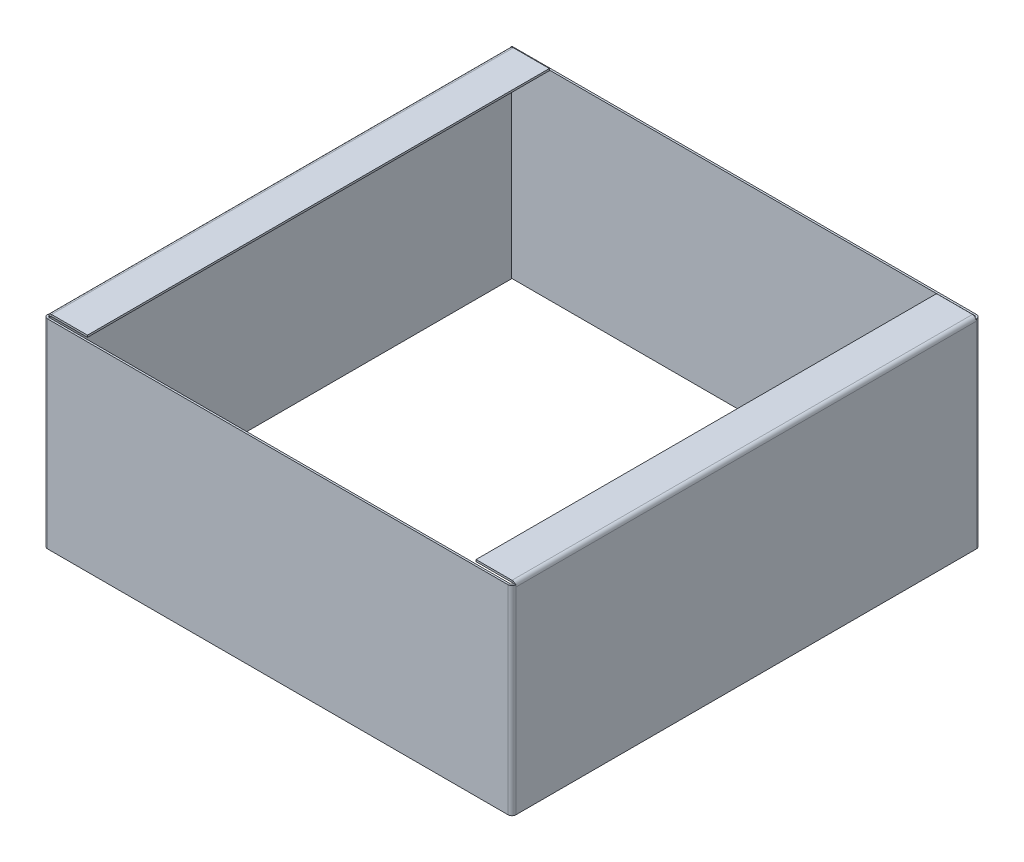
ISO-10303-21;
HEADER;
FILE_DESCRIPTION(('STEP AP214'),'2;1');
FILE_NAME('part.step','',(''),(''),'','','');
FILE_SCHEMA(('AUTOMOTIVE_DESIGN { 1 0 10303 214 1 1 1 1 }'));
ENDSEC;
DATA;
#1=APPLICATION_CONTEXT('core data for automotive mechanical design processes');
#2=APPLICATION_PROTOCOL_DEFINITION('international standard','automotive_design',2000,#1);
#3=PRODUCT_CONTEXT('',#1,'mechanical');
#4=PRODUCT('Part','Part','',(#3));
#5=PRODUCT_RELATED_PRODUCT_CATEGORY('part','',(#4));
#6=PRODUCT_DEFINITION_FORMATION('','',#4);
#7=PRODUCT_DEFINITION_CONTEXT('part definition',#1,'design');
#8=PRODUCT_DEFINITION('design','',#6,#7);
#9=PRODUCT_DEFINITION_SHAPE('','',#8);
#10=(LENGTH_UNIT() NAMED_UNIT(*) SI_UNIT(.MILLI.,.METRE.));
#11=(NAMED_UNIT(*) PLANE_ANGLE_UNIT() SI_UNIT($,.RADIAN.));
#12=(NAMED_UNIT(*) SI_UNIT($,.STERADIAN.) SOLID_ANGLE_UNIT());
#13=UNCERTAINTY_MEASURE_WITH_UNIT(LENGTH_MEASURE(1.E-05),#10,'distance_accuracy_value','');
#14=(GEOMETRIC_REPRESENTATION_CONTEXT(3) GLOBAL_UNCERTAINTY_ASSIGNED_CONTEXT((#13)) GLOBAL_UNIT_ASSIGNED_CONTEXT((#10,
#11,#12)) REPRESENTATION_CONTEXT('',''));
#15=CARTESIAN_POINT('',(0.,0.,0.));
#16=DIRECTION('',(0.,0.,1.));
#17=DIRECTION('',(1.,0.,0.));
#18=AXIS2_PLACEMENT_3D('',#15,#16,#17);
#19=CARTESIAN_POINT('',(0.,0.,-2.48412000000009));
#20=DIRECTION('',(0.,0.,-1.));
#21=DIRECTION('',(0.,1.,0.));
#22=AXIS2_PLACEMENT_3D('',#19,#20,#21);
#23=PLANE('',#22);
#24=DIRECTION('',(-1.,0.,0.));
#25=VECTOR('',#24,1.);
#26=CARTESIAN_POINT('',(0.,0.,-2.48412000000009));
#27=LINE('',#26,#25);
#28=CARTESIAN_POINT('',(-0.864936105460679,0.,-2.48412000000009));
#29=VERTEX_POINT('',#28);
#30=CARTESIAN_POINT('',(-1.21412000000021,0.,-2.48412000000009));
#31=VERTEX_POINT('',#30);
#32=EDGE_CURVE('E53',#29,#31,#27,.T.);
#33=ORIENTED_EDGE('',*,*,#32,.F.);
#34=CARTESIAN_POINT('',(1.27000000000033,-1.26999999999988,-2.48412000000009));
#35=DIRECTION('',(0.,0.,1.));
#36=DIRECTION('',(1.,0.,0.));
#37=AXIS2_PLACEMENT_3D('',#34,#35,#36);
#38=CIRCLE('',#37,2.48412);
#39=CARTESIAN_POINT('',(-1.21412000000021,-1.26999999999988,-2.48412000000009));
#40=VERTEX_POINT('',#39);
#41=EDGE_CURVE('E11',#29,#40,#38,.T.);
#42=ORIENTED_EDGE('',*,*,#41,.T.);
#43=DIRECTION('',(0.,-1.,0.));
#44=VECTOR('',#43,1.);
#45=CARTESIAN_POINT('',(-1.21412000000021,0.,-2.48412000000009));
#46=LINE('',#45,#44);
#47=EDGE_CURVE('E356',#31,#40,#46,.T.);
#48=ORIENTED_EDGE('',*,*,#47,.F.);
#49=EDGE_LOOP('',(#33,#42,#48));
#50=FACE_BOUND('',#49,.T.);
#51=ADVANCED_FACE('F36',(#50),#23,.T.);
#52=CARTESIAN_POINT('',(-1.21411999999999,0.,-1.21412000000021));
#53=DIRECTION('',(1.,0.,0.));
#54=DIRECTION('',(0.,0.,-1.));
#55=AXIS2_PLACEMENT_3D('',#52,#53,#54);
#56=PLANE('',#55);
#57=DIRECTION('',(0.,0.,1.));
#58=VECTOR('',#57,1.);
#59=CARTESIAN_POINT('',(-1.21412000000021,-1.26999999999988,-2.48412000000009));
#60=LINE('',#59,#58);
#61=CARTESIAN_POINT('',(-1.21412000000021,-1.26999999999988,-296.838370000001));
#62=VERTEX_POINT('',#61);
#63=EDGE_CURVE('E232',#40,#62,#60,.F.);
#64=ORIENTED_EDGE('',*,*,#63,.T.);
#65=DIRECTION('',(0.,-1.,0.));
#66=VECTOR('',#65,1.);
#67=CARTESIAN_POINT('',(-1.2141200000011,-127.,-296.83837));
#68=LINE('',#67,#66);
#69=CARTESIAN_POINT('',(-1.2141200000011,-127.,-296.83837));
#70=VERTEX_POINT('',#69);
#71=EDGE_CURVE('E360',#62,#70,#68,.T.);
#72=ORIENTED_EDGE('',*,*,#71,.T.);
#73=DIRECTION('',(0.,0.,1.));
#74=VECTOR('',#73,1.);
#75=CARTESIAN_POINT('',(-1.21412000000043,-127.,-1.21411999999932));
#76=LINE('',#75,#74);
#77=CARTESIAN_POINT('',(-1.21412000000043,-127.,-2.4841199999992));
#78=VERTEX_POINT('',#77);
#79=EDGE_CURVE('E362',#70,#78,#76,.T.);
#80=ORIENTED_EDGE('',*,*,#79,.T.);
#81=EDGE_CURVE('E353',#40,#78,#46,.T.);
#82=ORIENTED_EDGE('',*,*,#81,.F.);
#83=EDGE_LOOP('',(#64,#72,#80,#82));
#84=FACE_BOUND('',#83,.T.);
#85=ADVANCED_FACE('F627',(#84),#56,.F.);
#86=CARTESIAN_POINT('',(0.,0.,-1.21412000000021));
#87=DIRECTION('',(1.,0.,0.));
#88=DIRECTION('',(0.,0.,-1.));
#89=AXIS2_PLACEMENT_3D('',#86,#87,#88);
#90=PLANE('',#89);
#91=DIRECTION('',(0.,-1.,0.));
#92=VECTOR('',#91,1.);
#93=CARTESIAN_POINT('',(-8.88178419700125E-13,-127.,-296.83837));
#94=LINE('',#93,#92);
#95=CARTESIAN_POINT('',(-6.66133814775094E-13,-1.26999999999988,-296.838370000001));
#96=VERTEX_POINT('',#95);
#97=CARTESIAN_POINT('',(-8.88178419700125E-13,-127.,-296.83837));
#98=VERTEX_POINT('',#97);
#99=EDGE_CURVE('E359',#96,#98,#94,.T.);
#100=ORIENTED_EDGE('',*,*,#99,.F.);
#101=DIRECTION('',(0.,0.,1.));
#102=VECTOR('',#101,1.);
#103=CARTESIAN_POINT('',(0.,-1.26999999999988,-2.48412000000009));
#104=LINE('',#103,#102);
#105=CARTESIAN_POINT('',(0.,-1.26999999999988,-2.48412000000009));
#106=VERTEX_POINT('',#105);
#107=EDGE_CURVE('E282',#106,#96,#104,.F.);
#108=ORIENTED_EDGE('',*,*,#107,.F.);
#109=DIRECTION('',(0.,1.,0.));
#110=VECTOR('',#109,1.);
#111=CARTESIAN_POINT('',(-6.66133814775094E-13,-127.,-2.4841199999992));
#112=LINE('',#111,#110);
#113=CARTESIAN_POINT('',(-6.66133814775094E-13,-127.,-2.4841199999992));
#114=VERTEX_POINT('',#113);
#115=EDGE_CURVE('E349',#114,#106,#112,.T.);
#116=ORIENTED_EDGE('',*,*,#115,.F.);
#117=DIRECTION('',(0.,0.,1.));
#118=VECTOR('',#117,1.);
#119=CARTESIAN_POINT('',(-4.44089209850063E-13,-127.,-1.21411999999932));
#120=LINE('',#119,#118);
#121=EDGE_CURVE('E363',#98,#114,#120,.T.);
#122=ORIENTED_EDGE('',*,*,#121,.F.);
#123=EDGE_LOOP('',(#100,#108,#116,#122));
#124=FACE_BOUND('',#123,.T.);
#125=ADVANCED_FACE('F631',(#124),#90,.T.);
#126=CARTESIAN_POINT('',(-1.2141200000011,-127.,-296.83837));
#127=DIRECTION('',(0.,0.,1.));
#128=DIRECTION('',(1.,0.,0.));
#129=AXIS2_PLACEMENT_3D('',#126,#127,#128);
#130=PLANE('',#129);
#131=DIRECTION('',(-1.,0.,0.));
#132=VECTOR('',#131,1.);
#133=CARTESIAN_POINT('',(-6.66133814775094E-13,-1.26999999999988,-296.838370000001));
#134=LINE('',#133,#132);
#135=EDGE_CURVE('E278',#96,#62,#134,.T.);
#136=ORIENTED_EDGE('',*,*,#135,.F.);
#137=ORIENTED_EDGE('',*,*,#99,.T.);
#138=DIRECTION('',(1.,0.,0.));
#139=VECTOR('',#138,1.);
#140=CARTESIAN_POINT('',(-1.2141200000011,-127.,-296.83837));
#141=LINE('',#140,#139);
#142=EDGE_CURVE('E366',#70,#98,#141,.T.);
#143=ORIENTED_EDGE('',*,*,#142,.F.);
#144=ORIENTED_EDGE('',*,*,#71,.F.);
#145=EDGE_LOOP('',(#136,#137,#143,#144));
#146=FACE_BOUND('',#145,.T.);
#147=ADVANCED_FACE('F748',(#146),#130,.F.);
#148=CARTESIAN_POINT('',(296.02176,-1.27000000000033,-2.48412000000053));
#149=DIRECTION('',(0.,0.,-1.));
#150=DIRECTION('',(-1.,0.,0.));
#151=AXIS2_PLACEMENT_3D('',#148,#149,#150);
#152=PLANE('',#151);
#153=DIRECTION('',(0.,-1.,0.));
#154=VECTOR('',#153,1.);
#155=CARTESIAN_POINT('',(297.23588,-127.000000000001,-2.4841199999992));
#156=LINE('',#155,#154);
#157=CARTESIAN_POINT('',(297.23588,-1.27000000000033,-2.48412000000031));
#158=VERTEX_POINT('',#157);
#159=CARTESIAN_POINT('',(297.23588,-4.44089209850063E-13,-2.48412000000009));
#160=VERTEX_POINT('',#159);
#161=EDGE_CURVE('E345',#158,#160,#156,.F.);
#162=ORIENTED_EDGE('',*,*,#161,.F.);
#163=CARTESIAN_POINT('',(294.75176,-1.27000000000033,-2.48412000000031));
#164=DIRECTION('',(0.,0.,-1.));
#165=DIRECTION('',(-1.,0.,0.));
#166=AXIS2_PLACEMENT_3D('',#163,#164,#165);
#167=CIRCLE('',#166,2.48411999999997);
#168=CARTESIAN_POINT('',(296.886696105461,-4.44089209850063E-13,-2.48412000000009));
#169=VERTEX_POINT('',#168);
#170=EDGE_CURVE('E327',#158,#169,#167,.F.);
#171=ORIENTED_EDGE('',*,*,#170,.T.);
#172=DIRECTION('',(1.,0.,0.));
#173=VECTOR('',#172,1.);
#174=CARTESIAN_POINT('',(296.02176,-4.44089209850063E-13,-2.48412000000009));
#175=LINE('',#174,#173);
#176=EDGE_CURVE('E446',#169,#160,#175,.T.);
#177=ORIENTED_EDGE('',*,*,#176,.T.);
#178=EDGE_LOOP('',(#162,#171,#177));
#179=FACE_BOUND('',#178,.T.);
#180=ADVANCED_FACE('F585',(#179),#152,.T.);
#181=CARTESIAN_POINT('',(296.021760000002,0.,-295.96588));
#182=DIRECTION('',(0.,0.,1.));
#183=DIRECTION('',(0.,-1.,0.));
#184=AXIS2_PLACEMENT_3D('',#181,#182,#183);
#185=PLANE('',#184);
#186=DIRECTION('',(1.,0.,0.));
#187=VECTOR('',#186,1.);
#188=CARTESIAN_POINT('',(296.021760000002,0.,-295.96588));
#189=LINE('',#188,#187);
#190=CARTESIAN_POINT('',(296.886696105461,0.,-295.96588));
#191=VERTEX_POINT('',#190);
#192=CARTESIAN_POINT('',(297.235880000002,0.,-295.96588));
#193=VERTEX_POINT('',#192);
#194=EDGE_CURVE('E447',#191,#193,#189,.T.);
#195=ORIENTED_EDGE('',*,*,#194,.F.);
#196=CARTESIAN_POINT('',(294.751760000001,-1.26999999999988,-295.96588));
#197=DIRECTION('',(0.,0.,-1.));
#198=DIRECTION('',(-1.,0.,0.));
#199=AXIS2_PLACEMENT_3D('',#196,#197,#198);
#200=CIRCLE('',#199,2.48411999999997);
#201=CARTESIAN_POINT('',(297.235880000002,-1.26999999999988,-295.96588));
#202=VERTEX_POINT('',#201);
#203=EDGE_CURVE('E45',#191,#202,#200,.T.);
#204=ORIENTED_EDGE('',*,*,#203,.T.);
#205=DIRECTION('',(0.,-1.,0.));
#206=VECTOR('',#205,1.);
#207=CARTESIAN_POINT('',(297.235880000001,-127.,-295.965880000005));
#208=LINE('',#207,#206);
#209=EDGE_CURVE('E342',#193,#202,#208,.T.);
#210=ORIENTED_EDGE('',*,*,#209,.F.);
#211=EDGE_LOOP('',(#195,#204,#210));
#212=FACE_BOUND('',#211,.T.);
#213=ADVANCED_FACE('F574',(#212),#185,.T.);
#214=CARTESIAN_POINT('',(297.23588,-127.000000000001,-1.21411999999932));
#215=DIRECTION('',(-1.,0.,0.));
#216=DIRECTION('',(0.,0.,1.));
#217=AXIS2_PLACEMENT_3D('',#214,#215,#216);
#218=PLANE('',#217);
#219=DIRECTION('',(0.,0.,-1.));
#220=VECTOR('',#219,1.);
#221=CARTESIAN_POINT('',(297.235880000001,-1.26999999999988,-295.96588));
#222=LINE('',#221,#220);
#223=EDGE_CURVE('E322',#202,#158,#222,.F.);
#224=ORIENTED_EDGE('',*,*,#223,.T.);
#225=DIRECTION('',(0.,1.,0.));
#226=VECTOR('',#225,1.);
#227=CARTESIAN_POINT('',(297.23588,-127.000000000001,-2.4841199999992));
#228=LINE('',#227,#226);
#229=CARTESIAN_POINT('',(297.23588,-127.000000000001,-2.4841199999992));
#230=VERTEX_POINT('',#229);
#231=EDGE_CURVE('E457',#230,#158,#228,.T.);
#232=ORIENTED_EDGE('',*,*,#231,.F.);
#233=DIRECTION('',(0.,0.,-1.));
#234=VECTOR('',#233,1.);
#235=CARTESIAN_POINT('',(297.235880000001,-127.,-297.23588));
#236=LINE('',#235,#234);
#237=CARTESIAN_POINT('',(297.235880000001,-127.,-295.96588));
#238=VERTEX_POINT('',#237);
#239=EDGE_CURVE('E464',#230,#238,#236,.T.);
#240=ORIENTED_EDGE('',*,*,#239,.T.);
#241=DIRECTION('',(0.,-1.,0.));
#242=VECTOR('',#241,1.);
#243=CARTESIAN_POINT('',(297.235880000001,-127.,-295.96588));
#244=LINE('',#243,#242);
#245=EDGE_CURVE('E426',#238,#202,#244,.F.);
#246=ORIENTED_EDGE('',*,*,#245,.T.);
#247=EDGE_LOOP('',(#224,#232,#240,#246));
#248=FACE_BOUND('',#247,.T.);
#249=ADVANCED_FACE('F577',(#248),#218,.F.);
#250=CARTESIAN_POINT('',(296.02176,-127.000000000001,-1.21411999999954));
#251=DIRECTION('',(-1.,0.,0.));
#252=DIRECTION('',(0.,0.,1.));
#253=AXIS2_PLACEMENT_3D('',#250,#251,#252);
#254=PLANE('',#253);
#255=DIRECTION('',(0.,-1.,0.));
#256=VECTOR('',#255,1.);
#257=CARTESIAN_POINT('',(296.02176,-4.44089209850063E-13,-2.48412000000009));
#258=LINE('',#257,#256);
#259=CARTESIAN_POINT('',(296.02176,-1.27000000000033,-2.48412000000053));
#260=VERTEX_POINT('',#259);
#261=CARTESIAN_POINT('',(296.02176,-127.000000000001,-2.48411999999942));
#262=VERTEX_POINT('',#261);
#263=EDGE_CURVE('E454',#260,#262,#258,.T.);
#264=ORIENTED_EDGE('',*,*,#263,.F.);
#265=DIRECTION('',(0.,0.,-1.));
#266=VECTOR('',#265,1.);
#267=CARTESIAN_POINT('',(296.021760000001,-1.26999999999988,-295.96588));
#268=LINE('',#267,#266);
#269=CARTESIAN_POINT('',(296.021760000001,-1.26999999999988,-295.96588));
#270=VERTEX_POINT('',#269);
#271=EDGE_CURVE('E335',#270,#260,#268,.F.);
#272=ORIENTED_EDGE('',*,*,#271,.F.);
#273=DIRECTION('',(0.,-1.,0.));
#274=VECTOR('',#273,1.);
#275=CARTESIAN_POINT('',(296.021760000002,-127.,-295.96588));
#276=LINE('',#275,#274);
#277=CARTESIAN_POINT('',(296.021760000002,-127.,-295.96588));
#278=VERTEX_POINT('',#277);
#279=EDGE_CURVE('E439',#278,#270,#276,.F.);
#280=ORIENTED_EDGE('',*,*,#279,.F.);
#281=DIRECTION('',(0.,0.,-1.));
#282=VECTOR('',#281,1.);
#283=CARTESIAN_POINT('',(296.021760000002,-127.,-297.23588));
#284=LINE('',#283,#282);
#285=EDGE_CURVE('E463',#262,#278,#284,.T.);
#286=ORIENTED_EDGE('',*,*,#285,.F.);
#287=EDGE_LOOP('',(#264,#272,#280,#286));
#288=FACE_BOUND('',#287,.T.);
#289=ADVANCED_FACE('F532',(#288),#254,.T.);
#290=CARTESIAN_POINT('',(-4.44089209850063E-13,-127.,-1.21411999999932));
#291=DIRECTION('',(0.,0.,1.));
#292=DIRECTION('',(1.,0.,0.));
#293=AXIS2_PLACEMENT_3D('',#290,#291,#292);
#294=PLANE('',#293);
#295=DIRECTION('',(0.,1.,0.));
#296=VECTOR('',#295,1.);
#297=CARTESIAN_POINT('',(1.26999999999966,0.,-1.21412000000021));
#298=LINE('',#297,#296);
#299=CARTESIAN_POINT('',(1.26999999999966,0.,-1.21412000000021));
#300=VERTEX_POINT('',#299);
#301=CARTESIAN_POINT('',(1.26999999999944,-127.,-1.21411999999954));
#302=VERTEX_POINT('',#301);
#303=EDGE_CURVE('E386',#300,#302,#298,.F.);
#304=ORIENTED_EDGE('',*,*,#303,.F.);
#305=DIRECTION('',(-1.,0.,0.));
#306=VECTOR('',#305,1.);
#307=CARTESIAN_POINT('',(0.,0.,-1.21412000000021));
#308=LINE('',#307,#306);
#309=CARTESIAN_POINT('',(294.75176,-4.44089209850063E-13,-1.21412000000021));
#310=VERTEX_POINT('',#309);
#311=EDGE_CURVE('E494',#310,#300,#308,.T.);
#312=ORIENTED_EDGE('',*,*,#311,.F.);
#313=DIRECTION('',(0.,-1.,0.));
#314=VECTOR('',#313,1.);
#315=CARTESIAN_POINT('',(294.75176,-127.000000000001,-1.21411999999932));
#316=LINE('',#315,#314);
#317=CARTESIAN_POINT('',(294.75176,-127.000000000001,-1.21411999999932));
#318=VERTEX_POINT('',#317);
#319=EDGE_CURVE('E482',#318,#310,#316,.F.);
#320=ORIENTED_EDGE('',*,*,#319,.F.);
#321=DIRECTION('',(1.,0.,0.));
#322=VECTOR('',#321,1.);
#323=CARTESIAN_POINT('',(-4.44089209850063E-13,-127.,-1.21411999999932));
#324=LINE('',#323,#322);
#325=EDGE_CURVE('E492',#302,#318,#324,.T.);
#326=ORIENTED_EDGE('',*,*,#325,.F.);
#327=EDGE_LOOP('',(#304,#312,#320,#326));
#328=FACE_BOUND('',#327,.T.);
#329=ADVANCED_FACE('F516',(#328),#294,.F.);
#330=CARTESIAN_POINT('',(-4.44089209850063E-13,-127.,8.88178419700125E-13));
#331=DIRECTION('',(0.,0.,1.));
#332=DIRECTION('',(1.,0.,0.));
#333=AXIS2_PLACEMENT_3D('',#330,#331,#332);
#334=PLANE('',#333);
#335=DIRECTION('',(-1.,0.,0.));
#336=VECTOR('',#335,1.);
#337=CARTESIAN_POINT('',(0.,0.,0.));
#338=LINE('',#337,#336);
#339=CARTESIAN_POINT('',(294.75176,-4.44089209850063E-13,-2.22044604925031E-13));
#340=VERTEX_POINT('',#339);
#341=CARTESIAN_POINT('',(1.26999999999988,0.,-2.22044604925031E-13));
#342=VERTEX_POINT('',#341);
#343=EDGE_CURVE('E40',#340,#342,#338,.T.);
#344=ORIENTED_EDGE('',*,*,#343,.T.);
#345=DIRECTION('',(0.,1.,0.));
#346=VECTOR('',#345,1.);
#347=CARTESIAN_POINT('',(1.26999999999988,0.,-2.22044604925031E-13));
#348=LINE('',#347,#346);
#349=CARTESIAN_POINT('',(1.26999999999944,-127.,6.66133814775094E-13));
#350=VERTEX_POINT('',#349);
#351=EDGE_CURVE('E373',#342,#350,#348,.F.);
#352=ORIENTED_EDGE('',*,*,#351,.T.);
#353=DIRECTION('',(1.,0.,0.));
#354=VECTOR('',#353,1.);
#355=CARTESIAN_POINT('',(-4.44089209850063E-13,-127.,8.88178419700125E-13));
#356=LINE('',#355,#354);
#357=CARTESIAN_POINT('',(294.75176,-127.000000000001,8.88178419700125E-13));
#358=VERTEX_POINT('',#357);
#359=EDGE_CURVE('E489',#350,#358,#356,.T.);
#360=ORIENTED_EDGE('',*,*,#359,.T.);
#361=DIRECTION('',(0.,-1.,0.));
#362=VECTOR('',#361,1.);
#363=CARTESIAN_POINT('',(294.75176,-127.000000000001,8.88178419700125E-13));
#364=LINE('',#363,#362);
#365=EDGE_CURVE('E469',#358,#340,#364,.F.);
#366=ORIENTED_EDGE('',*,*,#365,.T.);
#367=EDGE_LOOP('',(#344,#352,#360,#366));
#368=FACE_BOUND('',#367,.T.);
#369=ADVANCED_FACE('F501',(#368),#334,.T.);
#370=CARTESIAN_POINT('',(0.,0.,-1.21412000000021));
#371=DIRECTION('',(0.,1.,0.));
#372=DIRECTION('',(0.,0.,1.));
#373=AXIS2_PLACEMENT_3D('',#370,#371,#372);
#374=PLANE('',#373);
#375=ORIENTED_EDGE('',*,*,#311,.T.);
#376=DIRECTION('',(0.,0.,1.));
#377=VECTOR('',#376,1.);
#378=CARTESIAN_POINT('',(1.26999999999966,0.,-1.21412000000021));
#379=LINE('',#378,#377);
#380=EDGE_CURVE('E380',#300,#342,#379,.T.);
#381=ORIENTED_EDGE('',*,*,#380,.T.);
#382=ORIENTED_EDGE('',*,*,#343,.F.);
#383=DIRECTION('',(0.,0.,1.));
#384=VECTOR('',#383,1.);
#385=CARTESIAN_POINT('',(294.75176,-4.44089209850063E-13,-1.21412000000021));
#386=LINE('',#385,#384);
#387=EDGE_CURVE('E486',#310,#340,#386,.T.);
#388=ORIENTED_EDGE('',*,*,#387,.F.);
#389=EDGE_LOOP('',(#375,#381,#382,#388));
#390=FACE_BOUND('',#389,.T.);
#391=ADVANCED_FACE('F504',(#390),#374,.T.);
#392=CARTESIAN_POINT('',(297.235880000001,-127.,-297.23588));
#393=DIRECTION('',(0.,1.,0.));
#394=DIRECTION('',(-1.,0.,0.));
#395=AXIS2_PLACEMENT_3D('',#392,#393,#394);
#396=PLANE('',#395);
#397=DIRECTION('',(1.,0.,0.));
#398=VECTOR('',#397,1.);
#399=CARTESIAN_POINT('',(296.021760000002,-127.,-295.96588));
#400=LINE('',#399,#398);
#401=EDGE_CURVE('E433',#278,#238,#400,.T.);
#402=ORIENTED_EDGE('',*,*,#401,.T.);
#403=ORIENTED_EDGE('',*,*,#239,.F.);
#404=DIRECTION('',(1.,0.,0.));
#405=VECTOR('',#404,1.);
#406=CARTESIAN_POINT('',(296.02176,-127.000000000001,-2.48411999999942));
#407=LINE('',#406,#405);
#408=EDGE_CURVE('E453',#262,#230,#407,.T.);
#409=ORIENTED_EDGE('',*,*,#408,.F.);
#410=ORIENTED_EDGE('',*,*,#285,.T.);
#411=EDGE_LOOP('',(#402,#403,#409,#410));
#412=FACE_BOUND('',#411,.T.);
#413=ADVANCED_FACE('F535',(#412),#396,.F.);
#414=CARTESIAN_POINT('',(-4.44089209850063E-13,-127.,-1.21411999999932));
#415=DIRECTION('',(0.,-1.,0.));
#416=DIRECTION('',(0.,0.,-1.));
#417=AXIS2_PLACEMENT_3D('',#414,#415,#416);
#418=PLANE('',#417);
#419=DIRECTION('',(0.,0.,1.));
#420=VECTOR('',#419,1.);
#421=CARTESIAN_POINT('',(1.26999999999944,-127.,-1.21411999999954));
#422=LINE('',#421,#420);
#423=EDGE_CURVE('E390',#302,#350,#422,.T.);
#424=ORIENTED_EDGE('',*,*,#423,.F.);
#425=ORIENTED_EDGE('',*,*,#325,.T.);
#426=DIRECTION('',(0.,0.,1.));
#427=VECTOR('',#426,1.);
#428=CARTESIAN_POINT('',(294.75176,-127.000000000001,-1.21411999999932));
#429=LINE('',#428,#427);
#430=EDGE_CURVE('E476',#318,#358,#429,.T.);
#431=ORIENTED_EDGE('',*,*,#430,.T.);
#432=ORIENTED_EDGE('',*,*,#359,.F.);
#433=EDGE_LOOP('',(#424,#425,#431,#432));
#434=FACE_BOUND('',#433,.T.);
#435=ADVANCED_FACE('F38',(#434),#418,.T.);
#436=CARTESIAN_POINT('',(294.75176,-4.44089209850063E-13,-2.48412000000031));
#437=DIRECTION('',(0.,1.,0.));
#438=DIRECTION('',(0.,0.,1.));
#439=AXIS2_PLACEMENT_3D('',#436,#437,#438);
#440=PLANE('',#439);
#441=CARTESIAN_POINT('',(296.02176,-4.44089209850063E-13,-2.48412000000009));
#442=VERTEX_POINT('',#441);
#443=EDGE_CURVE('E458',#442,#169,#175,.T.);
#444=ORIENTED_EDGE('',*,*,#443,.F.);
#445=CARTESIAN_POINT('',(294.75176,-4.44089209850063E-13,-2.48412000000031));
#446=DIRECTION('',(0.,-1.,0.));
#447=DIRECTION('',(0.,0.,-1.));
#448=AXIS2_PLACEMENT_3D('',#445,#446,#447);
#449=CIRCLE('',#448,1.26999999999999);
#450=EDGE_CURVE('E479',#310,#442,#449,.F.);
#451=ORIENTED_EDGE('',*,*,#450,.F.);
#452=ORIENTED_EDGE('',*,*,#387,.T.);
#453=CARTESIAN_POINT('',(294.75176,-4.44089209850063E-13,-2.48412000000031));
#454=DIRECTION('',(0.,-1.,0.));
#455=DIRECTION('',(0.,0.,-1.));
#456=AXIS2_PLACEMENT_3D('',#453,#454,#455);
#457=CIRCLE('',#456,2.48411999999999);
#458=EDGE_CURVE('E472',#340,#160,#457,.F.);
#459=ORIENTED_EDGE('',*,*,#458,.T.);
#460=ORIENTED_EDGE('',*,*,#176,.F.);
#461=EDGE_LOOP('',(#444,#451,#452,#459,#460));
#462=FACE_BOUND('',#461,.T.);
#463=ADVANCED_FACE('F587',(#462),#440,.T.);
#464=CARTESIAN_POINT('',(294.75176,-127.000000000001,-2.48411999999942));
#465=DIRECTION('',(0.,1.,0.));
#466=DIRECTION('',(0.,0.,1.));
#467=AXIS2_PLACEMENT_3D('',#464,#465,#466);
#468=PLANE('',#467);
#469=CARTESIAN_POINT('',(294.75176,-127.000000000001,-2.48411999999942));
#470=DIRECTION('',(0.,-1.,0.));
#471=DIRECTION('',(0.,0.,-1.));
#472=AXIS2_PLACEMENT_3D('',#469,#470,#471);
#473=CIRCLE('',#472,1.26999999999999);
#474=EDGE_CURVE('E466',#262,#318,#473,.T.);
#475=ORIENTED_EDGE('',*,*,#474,.F.);
#476=ORIENTED_EDGE('',*,*,#408,.T.);
#477=CARTESIAN_POINT('',(294.75176,-127.000000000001,-2.48411999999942));
#478=DIRECTION('',(0.,-1.,0.));
#479=DIRECTION('',(0.,0.,-1.));
#480=AXIS2_PLACEMENT_3D('',#477,#478,#479);
#481=CIRCLE('',#480,2.48411999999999);
#482=EDGE_CURVE('E473',#230,#358,#481,.T.);
#483=ORIENTED_EDGE('',*,*,#482,.T.);
#484=ORIENTED_EDGE('',*,*,#430,.F.);
#485=EDGE_LOOP('',(#475,#476,#483,#484));
#486=FACE_BOUND('',#485,.T.);
#487=ADVANCED_FACE('F523',(#486),#468,.F.);
#488=CARTESIAN_POINT('',(294.75176,-127.000000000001,-2.48411999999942));
#489=DIRECTION('',(0.,-1.,0.));
#490=DIRECTION('',(1.,0.,0.));
#491=AXIS2_PLACEMENT_3D('',#488,#489,#490);
#492=CYLINDRICAL_SURFACE('',#491,2.48411999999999);
#493=ORIENTED_EDGE('',*,*,#365,.F.);
#494=ORIENTED_EDGE('',*,*,#482,.F.);
#495=ORIENTED_EDGE('',*,*,#231,.T.);
#496=ORIENTED_EDGE('',*,*,#161,.T.);
#497=ORIENTED_EDGE('',*,*,#458,.F.);
#498=EDGE_LOOP('',(#493,#494,#495,#496,#497));
#499=FACE_BOUND('',#498,.T.);
#500=ADVANCED_FACE('F1042',(#499),#492,.T.);
#501=CARTESIAN_POINT('',(294.75176,-127.000000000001,-2.48411999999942));
#502=DIRECTION('',(0.,-1.,0.));
#503=DIRECTION('',(1.,0.,0.));
#504=AXIS2_PLACEMENT_3D('',#501,#502,#503);
#505=CYLINDRICAL_SURFACE('',#504,1.26999999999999);
#506=ORIENTED_EDGE('',*,*,#319,.T.);
#507=ORIENTED_EDGE('',*,*,#450,.T.);
#508=EDGE_CURVE('E450',#442,#260,#258,.T.);
#509=ORIENTED_EDGE('',*,*,#508,.T.);
#510=ORIENTED_EDGE('',*,*,#263,.T.);
#511=ORIENTED_EDGE('',*,*,#474,.T.);
#512=EDGE_LOOP('',(#506,#507,#509,#510,#511));
#513=FACE_BOUND('',#512,.T.);
#514=ADVANCED_FACE('F526',(#513),#505,.F.);
#515=CARTESIAN_POINT('',(294.751760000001,0.,-295.96588));
#516=DIRECTION('',(0.,1.,0.));
#517=DIRECTION('',(0.,0.,1.));
#518=AXIS2_PLACEMENT_3D('',#515,#516,#517);
#519=PLANE('',#518);
#520=DIRECTION('',(0.,0.,-1.));
#521=VECTOR('',#520,1.);
#522=CARTESIAN_POINT('',(294.751760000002,0.,-297.235880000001));
#523=LINE('',#522,#521);
#524=CARTESIAN_POINT('',(294.751760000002,0.,-297.235880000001));
#525=VERTEX_POINT('',#524);
#526=CARTESIAN_POINT('',(294.751760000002,0.,-298.45));
#527=VERTEX_POINT('',#526);
#528=EDGE_CURVE('E393',#525,#527,#523,.T.);
#529=ORIENTED_EDGE('',*,*,#528,.F.);
#530=CARTESIAN_POINT('',(294.751760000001,0.,-295.96588));
#531=DIRECTION('',(0.,-1.,0.));
#532=DIRECTION('',(0.,0.,-1.));
#533=AXIS2_PLACEMENT_3D('',#530,#531,#532);
#534=CIRCLE('',#533,1.27000000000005);
#535=CARTESIAN_POINT('',(296.021760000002,0.,-295.96588));
#536=VERTEX_POINT('',#535);
#537=EDGE_CURVE('E436',#536,#525,#534,.F.);
#538=ORIENTED_EDGE('',*,*,#537,.F.);
#539=EDGE_CURVE('E443',#536,#191,#189,.T.);
#540=ORIENTED_EDGE('',*,*,#539,.T.);
#541=ORIENTED_EDGE('',*,*,#194,.T.);
#542=CARTESIAN_POINT('',(294.751760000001,0.,-295.96588));
#543=DIRECTION('',(0.,-1.,0.));
#544=DIRECTION('',(0.,0.,-1.));
#545=AXIS2_PLACEMENT_3D('',#542,#543,#544);
#546=CIRCLE('',#545,2.48412000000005);
#547=EDGE_CURVE('E429',#193,#527,#546,.F.);
#548=ORIENTED_EDGE('',*,*,#547,.T.);
#549=EDGE_LOOP('',(#529,#538,#540,#541,#548));
#550=FACE_BOUND('',#549,.T.);
#551=ADVANCED_FACE('F569',(#550),#519,.T.);
#552=CARTESIAN_POINT('',(294.751760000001,-127.,-295.96588));
#553=DIRECTION('',(0.,1.,0.));
#554=DIRECTION('',(0.,0.,1.));
#555=AXIS2_PLACEMENT_3D('',#552,#553,#554);
#556=PLANE('',#555);
#557=CARTESIAN_POINT('',(294.751760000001,-127.,-295.96588));
#558=DIRECTION('',(0.,-1.,0.));
#559=DIRECTION('',(0.,0.,-1.));
#560=AXIS2_PLACEMENT_3D('',#557,#558,#559);
#561=CIRCLE('',#560,1.27000000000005);
#562=CARTESIAN_POINT('',(294.751760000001,-127.,-297.23588));
#563=VERTEX_POINT('',#562);
#564=EDGE_CURVE('E425',#563,#278,#561,.T.);
#565=ORIENTED_EDGE('',*,*,#564,.F.);
#566=DIRECTION('',(0.,0.,-1.));
#567=VECTOR('',#566,1.);
#568=CARTESIAN_POINT('',(294.751760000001,-127.,-297.23588));
#569=LINE('',#568,#567);
#570=CARTESIAN_POINT('',(294.751760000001,-127.,-298.449999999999));
#571=VERTEX_POINT('',#570);
#572=EDGE_CURVE('E398',#563,#571,#569,.T.);
#573=ORIENTED_EDGE('',*,*,#572,.T.);
#574=CARTESIAN_POINT('',(294.751760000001,-127.,-295.96588));
#575=DIRECTION('',(0.,-1.,0.));
#576=DIRECTION('',(0.,0.,-1.));
#577=AXIS2_PLACEMENT_3D('',#574,#575,#576);
#578=CIRCLE('',#577,2.48412000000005);
#579=EDGE_CURVE('E430',#571,#238,#578,.T.);
#580=ORIENTED_EDGE('',*,*,#579,.T.);
#581=ORIENTED_EDGE('',*,*,#401,.F.);
#582=EDGE_LOOP('',(#565,#573,#580,#581));
#583=FACE_BOUND('',#582,.T.);
#584=ADVANCED_FACE('F540',(#583),#556,.F.);
#585=CARTESIAN_POINT('',(294.751760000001,-127.,-295.96588));
#586=DIRECTION('',(0.,-1.,0.));
#587=DIRECTION('',(0.,0.,-1.));
#588=AXIS2_PLACEMENT_3D('',#585,#586,#587);
#589=CYLINDRICAL_SURFACE('',#588,2.48412000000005);
#590=ORIENTED_EDGE('',*,*,#245,.F.);
#591=ORIENTED_EDGE('',*,*,#579,.F.);
#592=DIRECTION('',(0.,1.,0.));
#593=VECTOR('',#592,1.);
#594=CARTESIAN_POINT('',(294.751760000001,-127.,-298.449999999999));
#595=LINE('',#594,#593);
#596=EDGE_CURVE('E401',#571,#527,#595,.T.);
#597=ORIENTED_EDGE('',*,*,#596,.T.);
#598=ORIENTED_EDGE('',*,*,#547,.F.);
#599=ORIENTED_EDGE('',*,*,#209,.T.);
#600=EDGE_LOOP('',(#590,#591,#597,#598,#599));
#601=FACE_BOUND('',#600,.T.);
#602=ADVANCED_FACE('F567',(#601),#589,.T.);
#603=CARTESIAN_POINT('',(294.751760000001,-127.,-295.96588));
#604=DIRECTION('',(0.,-1.,0.));
#605=DIRECTION('',(0.,0.,-1.));
#606=AXIS2_PLACEMENT_3D('',#603,#604,#605);
#607=CYLINDRICAL_SURFACE('',#606,1.27000000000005);
#608=ORIENTED_EDGE('',*,*,#279,.T.);
#609=DIRECTION('',(-4.37589981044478E-13,-1.,0.));
#610=VECTOR('',#609,1.);
#611=CARTESIAN_POINT('',(296.021760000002,0.,-295.96588));
#612=LINE('',#611,#610);
#613=EDGE_CURVE('E329',#536,#270,#612,.T.);
#614=ORIENTED_EDGE('',*,*,#613,.F.);
#615=ORIENTED_EDGE('',*,*,#537,.T.);
#616=DIRECTION('',(0.,-1.,0.));
#617=VECTOR('',#616,1.);
#618=CARTESIAN_POINT('',(294.751760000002,0.,-297.235880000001));
#619=LINE('',#618,#617);
#620=EDGE_CURVE('E396',#525,#563,#619,.T.);
#621=ORIENTED_EDGE('',*,*,#620,.T.);
#622=ORIENTED_EDGE('',*,*,#564,.T.);
#623=EDGE_LOOP('',(#608,#614,#615,#621,#622));
#624=FACE_BOUND('',#623,.T.);
#625=ADVANCED_FACE('F543',(#624),#607,.F.);
#626=CARTESIAN_POINT('',(-1.21411999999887,-127.,-298.450000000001));
#627=DIRECTION('',(0.,1.,0.));
#628=DIRECTION('',(-1.,0.,0.));
#629=AXIS2_PLACEMENT_3D('',#626,#627,#628);
#630=PLANE('',#629);
#631=ORIENTED_EDGE('',*,*,#572,.F.);
#632=DIRECTION('',(-1.,0.,0.));
#633=VECTOR('',#632,1.);
#634=CARTESIAN_POINT('',(-1.21411999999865,-127.,-297.235880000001));
#635=LINE('',#634,#633);
#636=CARTESIAN_POINT('',(-1.21411999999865,-127.,-297.235880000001));
#637=VERTEX_POINT('',#636);
#638=EDGE_CURVE('E405',#563,#637,#635,.T.);
#639=ORIENTED_EDGE('',*,*,#638,.T.);
#640=DIRECTION('',(0.,0.,1.));
#641=VECTOR('',#640,1.);
#642=CARTESIAN_POINT('',(-1.21411999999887,-127.,-298.450000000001));
#643=LINE('',#642,#641);
#644=CARTESIAN_POINT('',(-1.21411999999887,-127.,-298.450000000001));
#645=VERTEX_POINT('',#644);
#646=EDGE_CURVE('E422',#645,#637,#643,.T.);
#647=ORIENTED_EDGE('',*,*,#646,.F.);
#648=DIRECTION('',(-1.,0.,0.));
#649=VECTOR('',#648,1.);
#650=CARTESIAN_POINT('',(-1.21411999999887,-127.,-298.450000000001));
#651=LINE('',#650,#649);
#652=EDGE_CURVE('E406',#571,#645,#651,.T.);
#653=ORIENTED_EDGE('',*,*,#652,.F.);
#654=EDGE_LOOP('',(#631,#639,#647,#653));
#655=FACE_BOUND('',#654,.T.);
#656=ADVANCED_FACE('F561',(#655),#630,.F.);
#657=CARTESIAN_POINT('',(296.021760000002,0.,-298.45));
#658=DIRECTION('',(0.,-1.,0.));
#659=DIRECTION('',(1.,0.,0.));
#660=AXIS2_PLACEMENT_3D('',#657,#658,#659);
#661=PLANE('',#660);
#662=ORIENTED_EDGE('',*,*,#528,.T.);
#663=DIRECTION('',(1.,0.,0.));
#664=VECTOR('',#663,1.);
#665=CARTESIAN_POINT('',(296.021760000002,0.,-298.45));
#666=LINE('',#665,#664);
#667=CARTESIAN_POINT('',(-1.21411999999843,0.,-298.450000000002));
#668=VERTEX_POINT('',#667);
#669=EDGE_CURVE('E411',#668,#527,#666,.T.);
#670=ORIENTED_EDGE('',*,*,#669,.F.);
#671=DIRECTION('',(0.,0.,1.));
#672=VECTOR('',#671,1.);
#673=CARTESIAN_POINT('',(-1.21411999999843,0.,-298.450000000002));
#674=LINE('',#673,#672);
#675=CARTESIAN_POINT('',(-1.21411999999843,0.,-297.235880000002));
#676=VERTEX_POINT('',#675);
#677=EDGE_CURVE('E414',#668,#676,#674,.T.);
#678=ORIENTED_EDGE('',*,*,#677,.T.);
#679=DIRECTION('',(1.,0.,0.));
#680=VECTOR('',#679,1.);
#681=CARTESIAN_POINT('',(296.021760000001,0.,-297.235880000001));
#682=LINE('',#681,#680);
#683=EDGE_CURVE('E409',#676,#525,#682,.T.);
#684=ORIENTED_EDGE('',*,*,#683,.T.);
#685=EDGE_LOOP('',(#662,#670,#678,#684));
#686=FACE_BOUND('',#685,.T.);
#687=ADVANCED_FACE('F552',(#686),#661,.F.);
#688=CARTESIAN_POINT('',(296.021760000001,-127.,-298.449999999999));
#689=DIRECTION('',(0.,0.,1.));
#690=DIRECTION('',(1.,0.,0.));
#691=AXIS2_PLACEMENT_3D('',#688,#689,#690);
#692=PLANE('',#691);
#693=ORIENTED_EDGE('',*,*,#596,.F.);
#694=ORIENTED_EDGE('',*,*,#652,.T.);
#695=DIRECTION('',(0.,1.,0.));
#696=VECTOR('',#695,1.);
#697=CARTESIAN_POINT('',(-1.21411999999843,0.,-298.450000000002));
#698=LINE('',#697,#696);
#699=EDGE_CURVE('E408',#645,#668,#698,.T.);
#700=ORIENTED_EDGE('',*,*,#699,.T.);
#701=ORIENTED_EDGE('',*,*,#669,.T.);
#702=EDGE_LOOP('',(#693,#694,#700,#701));
#703=FACE_BOUND('',#702,.T.);
#704=ADVANCED_FACE('F564',(#703),#692,.F.);
#705=CARTESIAN_POINT('',(296.021760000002,-127.,-297.23588));
#706=DIRECTION('',(0.,0.,1.));
#707=DIRECTION('',(1.,0.,0.));
#708=AXIS2_PLACEMENT_3D('',#705,#706,#707);
#709=PLANE('',#708);
#710=ORIENTED_EDGE('',*,*,#638,.F.);
#711=ORIENTED_EDGE('',*,*,#620,.F.);
#712=ORIENTED_EDGE('',*,*,#683,.F.);
#713=DIRECTION('',(0.,1.,0.));
#714=VECTOR('',#713,1.);
#715=CARTESIAN_POINT('',(-1.21411999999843,0.,-297.235880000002));
#716=LINE('',#715,#714);
#717=EDGE_CURVE('E416',#637,#676,#716,.T.);
#718=ORIENTED_EDGE('',*,*,#717,.F.);
#719=EDGE_LOOP('',(#710,#711,#712,#718));
#720=FACE_BOUND('',#719,.T.);
#721=ADVANCED_FACE('F549',(#720),#709,.T.);
#722=CARTESIAN_POINT('',(-1.21411999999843,0.,-298.450000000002));
#723=DIRECTION('',(1.,0.,0.));
#724=DIRECTION('',(0.,0.,-1.));
#725=AXIS2_PLACEMENT_3D('',#722,#723,#724);
#726=PLANE('',#725);
#727=ORIENTED_EDGE('',*,*,#717,.T.);
#728=ORIENTED_EDGE('',*,*,#677,.F.);
#729=ORIENTED_EDGE('',*,*,#699,.F.);
#730=ORIENTED_EDGE('',*,*,#646,.T.);
#731=EDGE_LOOP('',(#727,#728,#729,#730));
#732=FACE_BOUND('',#731,.T.);
#733=ADVANCED_FACE('F557',(#732),#726,.F.);
#734=CARTESIAN_POINT('',(1.26999999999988,-127.,-2.48411999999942));
#735=DIRECTION('',(0.,-1.,0.));
#736=DIRECTION('',(1.,0.,0.));
#737=AXIS2_PLACEMENT_3D('',#734,#735,#736);
#738=PLANE('',#737);
#739=DIRECTION('',(-1.,0.,0.));
#740=VECTOR('',#739,1.);
#741=CARTESIAN_POINT('',(-6.66133814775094E-13,-127.,-2.4841199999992));
#742=LINE('',#741,#740);
#743=EDGE_CURVE('E348',#114,#78,#742,.T.);
#744=ORIENTED_EDGE('',*,*,#743,.F.);
#745=CARTESIAN_POINT('',(1.26999999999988,-127.,-2.48411999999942));
#746=DIRECTION('',(0.,1.,0.));
#747=DIRECTION('',(-1.,0.,0.));
#748=AXIS2_PLACEMENT_3D('',#745,#746,#747);
#749=CIRCLE('',#748,1.27);
#750=EDGE_CURVE('E383',#302,#114,#749,.F.);
#751=ORIENTED_EDGE('',*,*,#750,.F.);
#752=ORIENTED_EDGE('',*,*,#423,.T.);
#753=CARTESIAN_POINT('',(1.26999999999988,-127.,-2.48411999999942));
#754=DIRECTION('',(0.,1.,0.));
#755=DIRECTION('',(-1.,0.,0.));
#756=AXIS2_PLACEMENT_3D('',#753,#754,#755);
#757=CIRCLE('',#756,2.48412);
#758=EDGE_CURVE('E376',#350,#78,#757,.F.);
#759=ORIENTED_EDGE('',*,*,#758,.T.);
#760=EDGE_LOOP('',(#744,#751,#752,#759));
#761=FACE_BOUND('',#760,.T.);
#762=ADVANCED_FACE('F901',(#761),#738,.T.);
#763=CARTESIAN_POINT('',(1.27000000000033,0.,-2.48412000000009));
#764=DIRECTION('',(0.,-1.,0.));
#765=DIRECTION('',(1.,0.,0.));
#766=AXIS2_PLACEMENT_3D('',#763,#764,#765);
#767=PLANE('',#766);
#768=CARTESIAN_POINT('',(1.27000000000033,0.,-2.48412000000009));
#769=DIRECTION('',(0.,1.,0.));
#770=DIRECTION('',(-1.,0.,0.));
#771=AXIS2_PLACEMENT_3D('',#768,#769,#770);
#772=CIRCLE('',#771,1.27);
#773=CARTESIAN_POINT('',(0.,0.,-2.48412000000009));
#774=VERTEX_POINT('',#773);
#775=EDGE_CURVE('E372',#774,#300,#772,.T.);
#776=ORIENTED_EDGE('',*,*,#775,.F.);
#777=EDGE_CURVE('E351',#774,#29,#27,.T.);
#778=ORIENTED_EDGE('',*,*,#777,.T.);
#779=ORIENTED_EDGE('',*,*,#32,.T.);
#780=CARTESIAN_POINT('',(1.27000000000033,0.,-2.48412000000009));
#781=DIRECTION('',(0.,1.,0.));
#782=DIRECTION('',(-1.,0.,0.));
#783=AXIS2_PLACEMENT_3D('',#780,#781,#782);
#784=CIRCLE('',#783,2.48412);
#785=EDGE_CURVE('E377',#31,#342,#784,.T.);
#786=ORIENTED_EDGE('',*,*,#785,.T.);
#787=ORIENTED_EDGE('',*,*,#380,.F.);
#788=EDGE_LOOP('',(#776,#778,#779,#786,#787));
#789=FACE_BOUND('',#788,.T.);
#790=ADVANCED_FACE('F508',(#789),#767,.F.);
#791=CARTESIAN_POINT('',(1.27000000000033,0.,-2.48412000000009));
#792=DIRECTION('',(0.,1.,0.));
#793=DIRECTION('',(-1.,0.,0.));
#794=AXIS2_PLACEMENT_3D('',#791,#792,#793);
#795=CYLINDRICAL_SURFACE('',#794,2.48412);
#796=ORIENTED_EDGE('',*,*,#351,.F.);
#797=ORIENTED_EDGE('',*,*,#785,.F.);
#798=ORIENTED_EDGE('',*,*,#47,.T.);
#799=ORIENTED_EDGE('',*,*,#81,.T.);
#800=ORIENTED_EDGE('',*,*,#758,.F.);
#801=EDGE_LOOP('',(#796,#797,#798,#799,#800));
#802=FACE_BOUND('',#801,.T.);
#803=ADVANCED_FACE('F889',(#802),#795,.T.);
#804=CARTESIAN_POINT('',(1.27000000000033,0.,-2.48412000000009));
#805=DIRECTION('',(0.,1.,0.));
#806=DIRECTION('',(-1.,0.,0.));
#807=AXIS2_PLACEMENT_3D('',#804,#805,#806);
#808=CYLINDRICAL_SURFACE('',#807,1.27);
#809=ORIENTED_EDGE('',*,*,#303,.T.);
#810=ORIENTED_EDGE('',*,*,#750,.T.);
#811=ORIENTED_EDGE('',*,*,#115,.T.);
#812=DIRECTION('',(0.,-1.,0.));
#813=VECTOR('',#812,1.);
#814=CARTESIAN_POINT('',(0.,0.,-2.48412000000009));
#815=LINE('',#814,#813);
#816=EDGE_CURVE('E288',#774,#106,#815,.T.);
#817=ORIENTED_EDGE('',*,*,#816,.F.);
#818=ORIENTED_EDGE('',*,*,#775,.T.);
#819=EDGE_LOOP('',(#809,#810,#811,#817,#818));
#820=FACE_BOUND('',#819,.T.);
#821=ADVANCED_FACE('F512',(#820),#808,.F.);
#822=CARTESIAN_POINT('',(-1.21412000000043,-127.,-1.21411999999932));
#823=DIRECTION('',(0.,1.,0.));
#824=DIRECTION('',(-1.,0.,0.));
#825=AXIS2_PLACEMENT_3D('',#822,#823,#824);
#826=PLANE('',#825);
#827=ORIENTED_EDGE('',*,*,#743,.T.);
#828=ORIENTED_EDGE('',*,*,#79,.F.);
#829=ORIENTED_EDGE('',*,*,#142,.T.);
#830=ORIENTED_EDGE('',*,*,#121,.T.);
#831=EDGE_LOOP('',(#827,#828,#829,#830));
#832=FACE_BOUND('',#831,.T.);
#833=ADVANCED_FACE('F832',(#832),#826,.F.);
#834=CARTESIAN_POINT('',(294.75176,-1.27000000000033,-2.48412000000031));
#835=DIRECTION('',(0.,0.,1.));
#836=DIRECTION('',(1.,0.,0.));
#837=AXIS2_PLACEMENT_3D('',#834,#835,#836);
#838=PLANE('',#837);
#839=ORIENTED_EDGE('',*,*,#508,.F.);
#840=ORIENTED_EDGE('',*,*,#443,.T.);
#841=CARTESIAN_POINT('',(294.75176,1.21411999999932,-2.48412000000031));
#842=VERTEX_POINT('',#841);
#843=EDGE_CURVE('E325',#169,#842,#167,.F.);
#844=ORIENTED_EDGE('',*,*,#843,.T.);
#845=DIRECTION('',(0.,1.,0.));
#846=VECTOR('',#845,1.);
#847=CARTESIAN_POINT('',(294.75176,-4.44089209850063E-13,-2.48412000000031));
#848=LINE('',#847,#846);
#849=CARTESIAN_POINT('',(294.75176,-4.44089209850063E-13,-2.48412000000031));
#850=VERTEX_POINT('',#849);
#851=EDGE_CURVE('E290',#850,#842,#848,.T.);
#852=ORIENTED_EDGE('',*,*,#851,.F.);
#853=CARTESIAN_POINT('',(294.75176,-1.27000000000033,-2.48412000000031));
#854=DIRECTION('',(0.,0.,-1.));
#855=DIRECTION('',(-1.,0.,0.));
#856=AXIS2_PLACEMENT_3D('',#853,#854,#855);
#857=CIRCLE('',#856,1.26999999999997);
#858=EDGE_CURVE('E332',#260,#850,#857,.F.);
#859=ORIENTED_EDGE('',*,*,#858,.F.);
#860=EDGE_LOOP('',(#839,#840,#844,#852,#859));
#861=FACE_BOUND('',#860,.T.);
#862=ADVANCED_FACE('F589',(#861),#838,.T.);
#863=CARTESIAN_POINT('',(294.751760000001,-1.26999999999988,-295.96588));
#864=DIRECTION('',(0.,0.,1.));
#865=DIRECTION('',(1.,0.,0.));
#866=AXIS2_PLACEMENT_3D('',#863,#864,#865);
#867=PLANE('',#866);
#868=ORIENTED_EDGE('',*,*,#539,.F.);
#869=ORIENTED_EDGE('',*,*,#613,.T.);
#870=CARTESIAN_POINT('',(294.751760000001,-1.26999999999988,-295.96588));
#871=DIRECTION('',(0.,0.,-1.));
#872=DIRECTION('',(-1.,0.,0.));
#873=AXIS2_PLACEMENT_3D('',#870,#871,#872);
#874=CIRCLE('',#873,1.26999999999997);
#875=CARTESIAN_POINT('',(294.751760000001,0.,-295.96588));
#876=VERTEX_POINT('',#875);
#877=EDGE_CURVE('E321',#876,#270,#874,.T.);
#878=ORIENTED_EDGE('',*,*,#877,.F.);
#879=DIRECTION('',(0.,1.,0.));
#880=VECTOR('',#879,1.);
#881=CARTESIAN_POINT('',(294.751760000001,0.,-295.96588));
#882=LINE('',#881,#880);
#883=CARTESIAN_POINT('',(294.751760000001,1.21412000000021,-295.96588));
#884=VERTEX_POINT('',#883);
#885=EDGE_CURVE('E293',#876,#884,#882,.T.);
#886=ORIENTED_EDGE('',*,*,#885,.T.);
#887=EDGE_CURVE('E326',#884,#191,#200,.T.);
#888=ORIENTED_EDGE('',*,*,#887,.T.);
#889=EDGE_LOOP('',(#868,#869,#878,#886,#888));
#890=FACE_BOUND('',#889,.T.);
#891=ADVANCED_FACE('F614',(#890),#867,.F.);
#892=CARTESIAN_POINT('',(294.751760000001,-1.26999999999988,-295.96588));
#893=DIRECTION('',(0.,0.,-1.));
#894=DIRECTION('',(0.,1.,0.));
#895=AXIS2_PLACEMENT_3D('',#892,#893,#894);
#896=CYLINDRICAL_SURFACE('',#895,2.48411999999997);
#897=ORIENTED_EDGE('',*,*,#223,.F.);
#898=ORIENTED_EDGE('',*,*,#203,.F.);
#899=ORIENTED_EDGE('',*,*,#887,.F.);
#900=DIRECTION('',(0.,0.,1.));
#901=VECTOR('',#900,1.);
#902=CARTESIAN_POINT('',(294.751760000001,1.21412000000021,-295.96588));
#903=LINE('',#902,#901);
#904=EDGE_CURVE('E296',#884,#842,#903,.T.);
#905=ORIENTED_EDGE('',*,*,#904,.T.);
#906=ORIENTED_EDGE('',*,*,#843,.F.);
#907=ORIENTED_EDGE('',*,*,#170,.F.);
#908=EDGE_LOOP('',(#897,#898,#899,#905,#906,#907));
#909=FACE_BOUND('',#908,.T.);
#910=ADVANCED_FACE('F581',(#909),#896,.T.);
#911=CARTESIAN_POINT('',(294.751760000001,-1.26999999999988,-295.96588));
#912=DIRECTION('',(0.,0.,-1.));
#913=DIRECTION('',(0.,1.,0.));
#914=AXIS2_PLACEMENT_3D('',#911,#912,#913);
#915=CYLINDRICAL_SURFACE('',#914,1.26999999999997);
#916=ORIENTED_EDGE('',*,*,#271,.T.);
#917=ORIENTED_EDGE('',*,*,#858,.T.);
#918=DIRECTION('',(0.,0.,-1.));
#919=VECTOR('',#918,1.);
#920=CARTESIAN_POINT('',(294.75176,-4.44089209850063E-13,-2.48412000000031));
#921=LINE('',#920,#919);
#922=EDGE_CURVE('E291',#850,#876,#921,.T.);
#923=ORIENTED_EDGE('',*,*,#922,.T.);
#924=ORIENTED_EDGE('',*,*,#877,.T.);
#925=EDGE_LOOP('',(#916,#917,#923,#924));
#926=FACE_BOUND('',#925,.T.);
#927=ADVANCED_FACE('F593',(#926),#915,.F.);
#928=CARTESIAN_POINT('',(271.835880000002,1.21412000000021,-295.96588));
#929=DIRECTION('',(0.,0.,1.));
#930=DIRECTION('',(1.,0.,0.));
#931=AXIS2_PLACEMENT_3D('',#928,#929,#930);
#932=PLANE('',#931);
#933=ORIENTED_EDGE('',*,*,#885,.F.);
#934=DIRECTION('',(-1.,0.,0.));
#935=VECTOR('',#934,1.);
#936=CARTESIAN_POINT('',(271.835880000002,0.,-295.96588));
#937=LINE('',#936,#935);
#938=CARTESIAN_POINT('',(271.835880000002,0.,-295.96588));
#939=VERTEX_POINT('',#938);
#940=EDGE_CURVE('E301',#876,#939,#937,.T.);
#941=ORIENTED_EDGE('',*,*,#940,.T.);
#942=DIRECTION('',(0.,-1.,0.));
#943=VECTOR('',#942,1.);
#944=CARTESIAN_POINT('',(271.835880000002,1.21412000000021,-295.96588));
#945=LINE('',#944,#943);
#946=CARTESIAN_POINT('',(271.835880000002,1.21412000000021,-295.96588));
#947=VERTEX_POINT('',#946);
#948=EDGE_CURVE('E318',#947,#939,#945,.T.);
#949=ORIENTED_EDGE('',*,*,#948,.F.);
#950=DIRECTION('',(-1.,0.,0.));
#951=VECTOR('',#950,1.);
#952=CARTESIAN_POINT('',(271.835880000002,1.21412000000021,-295.96588));
#953=LINE('',#952,#951);
#954=EDGE_CURVE('E302',#884,#947,#953,.T.);
#955=ORIENTED_EDGE('',*,*,#954,.F.);
#956=EDGE_LOOP('',(#933,#941,#949,#955));
#957=FACE_BOUND('',#956,.T.);
#958=ADVANCED_FACE('F611',(#957),#932,.F.);
#959=CARTESIAN_POINT('',(296.02176,1.21411999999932,-2.48412000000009));
#960=DIRECTION('',(0.,0.,-1.));
#961=DIRECTION('',(-1.,0.,0.));
#962=AXIS2_PLACEMENT_3D('',#959,#960,#961);
#963=PLANE('',#962);
#964=ORIENTED_EDGE('',*,*,#851,.T.);
#965=DIRECTION('',(1.,0.,0.));
#966=VECTOR('',#965,1.);
#967=CARTESIAN_POINT('',(296.02176,1.21411999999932,-2.48412000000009));
#968=LINE('',#967,#966);
#969=CARTESIAN_POINT('',(271.83588,1.21411999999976,-2.48412000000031));
#970=VERTEX_POINT('',#969);
#971=EDGE_CURVE('E307',#970,#842,#968,.T.);
#972=ORIENTED_EDGE('',*,*,#971,.F.);
#973=DIRECTION('',(0.,-1.,0.));
#974=VECTOR('',#973,1.);
#975=CARTESIAN_POINT('',(271.83588,1.21411999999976,-2.48412000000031));
#976=LINE('',#975,#974);
#977=CARTESIAN_POINT('',(271.83588,-4.44089209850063E-13,-2.48412000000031));
#978=VERTEX_POINT('',#977);
#979=EDGE_CURVE('E310',#970,#978,#976,.T.);
#980=ORIENTED_EDGE('',*,*,#979,.T.);
#981=DIRECTION('',(1.,0.,0.));
#982=VECTOR('',#981,1.);
#983=CARTESIAN_POINT('',(296.02176,-4.44089209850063E-13,-2.48412000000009));
#984=LINE('',#983,#982);
#985=EDGE_CURVE('E305',#978,#850,#984,.T.);
#986=ORIENTED_EDGE('',*,*,#985,.T.);
#987=EDGE_LOOP('',(#964,#972,#980,#986));
#988=FACE_BOUND('',#987,.T.);
#989=ADVANCED_FACE('F601',(#988),#963,.F.);
#990=CARTESIAN_POINT('',(296.021760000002,1.21412000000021,-295.96588));
#991=DIRECTION('',(0.,-1.,0.));
#992=DIRECTION('',(1.,0.,0.));
#993=AXIS2_PLACEMENT_3D('',#990,#991,#992);
#994=PLANE('',#993);
#995=ORIENTED_EDGE('',*,*,#904,.F.);
#996=ORIENTED_EDGE('',*,*,#954,.T.);
#997=DIRECTION('',(0.,0.,1.));
#998=VECTOR('',#997,1.);
#999=CARTESIAN_POINT('',(271.83588,1.21411999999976,-2.48412000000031));
#1000=LINE('',#999,#998);
#1001=EDGE_CURVE('E304',#947,#970,#1000,.T.);
#1002=ORIENTED_EDGE('',*,*,#1001,.T.);
#1003=ORIENTED_EDGE('',*,*,#971,.T.);
#1004=EDGE_LOOP('',(#995,#996,#1002,#1003));
#1005=FACE_BOUND('',#1004,.T.);
#1006=ADVANCED_FACE('F616',(#1005),#994,.F.);
#1007=CARTESIAN_POINT('',(296.021760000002,0.,-295.96588));
#1008=DIRECTION('',(0.,-1.,0.));
#1009=DIRECTION('',(1.,0.,0.));
#1010=AXIS2_PLACEMENT_3D('',#1007,#1008,#1009);
#1011=PLANE('',#1010);
#1012=ORIENTED_EDGE('',*,*,#940,.F.);
#1013=ORIENTED_EDGE('',*,*,#922,.F.);
#1014=ORIENTED_EDGE('',*,*,#985,.F.);
#1015=DIRECTION('',(0.,0.,1.));
#1016=VECTOR('',#1015,1.);
#1017=CARTESIAN_POINT('',(271.83588,-4.44089209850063E-13,-2.48412000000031));
#1018=LINE('',#1017,#1016);
#1019=EDGE_CURVE('E312',#939,#978,#1018,.T.);
#1020=ORIENTED_EDGE('',*,*,#1019,.F.);
#1021=EDGE_LOOP('',(#1012,#1013,#1014,#1020));
#1022=FACE_BOUND('',#1021,.T.);
#1023=ADVANCED_FACE('F598',(#1022),#1011,.T.);
#1024=CARTESIAN_POINT('',(271.83588,1.21411999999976,-2.48412000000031));
#1025=DIRECTION('',(1.,0.,0.));
#1026=DIRECTION('',(0.,0.,-1.));
#1027=AXIS2_PLACEMENT_3D('',#1024,#1025,#1026);
#1028=PLANE('',#1027);
#1029=ORIENTED_EDGE('',*,*,#1019,.T.);
#1030=ORIENTED_EDGE('',*,*,#979,.F.);
#1031=ORIENTED_EDGE('',*,*,#1001,.F.);
#1032=ORIENTED_EDGE('',*,*,#948,.T.);
#1033=EDGE_LOOP('',(#1029,#1030,#1031,#1032));
#1034=FACE_BOUND('',#1033,.T.);
#1035=ADVANCED_FACE('F606',(#1034),#1028,.F.);
#1036=CARTESIAN_POINT('',(1.27000000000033,-1.26999999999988,-2.48412000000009));
#1037=DIRECTION('',(0.,0.,-1.));
#1038=DIRECTION('',(-1.,0.,0.));
#1039=AXIS2_PLACEMENT_3D('',#1036,#1037,#1038);
#1040=PLANE('',#1039);
#1041=ORIENTED_EDGE('',*,*,#777,.F.);
#1042=ORIENTED_EDGE('',*,*,#816,.T.);
#1043=CARTESIAN_POINT('',(1.27000000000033,-1.26999999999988,-2.48412000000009));
#1044=DIRECTION('',(0.,0.,1.));
#1045=DIRECTION('',(1.,0.,0.));
#1046=AXIS2_PLACEMENT_3D('',#1043,#1044,#1045);
#1047=CIRCLE('',#1046,1.27);
#1048=CARTESIAN_POINT('',(1.27000000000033,0.,-2.48412000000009));
#1049=VERTEX_POINT('',#1048);
#1050=EDGE_CURVE('E240',#1049,#106,#1047,.T.);
#1051=ORIENTED_EDGE('',*,*,#1050,.F.);
#1052=DIRECTION('',(0.,1.,0.));
#1053=VECTOR('',#1052,1.);
#1054=CARTESIAN_POINT('',(1.27000000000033,0.,-2.48412000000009));
#1055=LINE('',#1054,#1053);
#1056=CARTESIAN_POINT('',(1.27000000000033,1.21411999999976,-2.48412000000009));
#1057=VERTEX_POINT('',#1056);
#1058=EDGE_CURVE('E236',#1049,#1057,#1055,.T.);
#1059=ORIENTED_EDGE('',*,*,#1058,.T.);
#1060=EDGE_CURVE('E47',#1057,#29,#38,.T.);
#1061=ORIENTED_EDGE('',*,*,#1060,.T.);
#1062=EDGE_LOOP('',(#1041,#1042,#1051,#1059,#1061));
#1063=FACE_BOUND('',#1062,.T.);
#1064=ADVANCED_FACE('F237',(#1063),#1040,.F.);
#1065=CARTESIAN_POINT('',(1.26999999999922,-1.26999999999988,-296.838370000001));
#1066=DIRECTION('',(0.,0.,-1.));
#1067=DIRECTION('',(-1.,0.,0.));
#1068=AXIS2_PLACEMENT_3D('',#1065,#1066,#1067);
#1069=PLANE('',#1068);
#1070=DIRECTION('',(0.,1.,0.));
#1071=VECTOR('',#1070,1.);
#1072=CARTESIAN_POINT('',(1.26999999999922,0.,-296.838370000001));
#1073=LINE('',#1072,#1071);
#1074=CARTESIAN_POINT('',(1.26999999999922,0.,-296.838370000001));
#1075=VERTEX_POINT('',#1074);
#1076=CARTESIAN_POINT('',(1.26999999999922,1.21412000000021,-296.838370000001));
#1077=VERTEX_POINT('',#1076);
#1078=EDGE_CURVE('E1131',#1075,#1077,#1073,.T.);
#1079=ORIENTED_EDGE('',*,*,#1078,.F.);
#1080=CARTESIAN_POINT('',(1.26999999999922,-1.26999999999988,-296.838370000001));
#1081=DIRECTION('',(0.,0.,1.));
#1082=DIRECTION('',(1.,0.,0.));
#1083=AXIS2_PLACEMENT_3D('',#1080,#1081,#1082);
#1084=CIRCLE('',#1083,1.27);
#1085=EDGE_CURVE('E233',#96,#1075,#1084,.F.);
#1086=ORIENTED_EDGE('',*,*,#1085,.F.);
#1087=ORIENTED_EDGE('',*,*,#135,.T.);
#1088=CARTESIAN_POINT('',(1.26999999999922,-1.26999999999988,-296.838370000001));
#1089=DIRECTION('',(0.,0.,1.));
#1090=DIRECTION('',(1.,0.,0.));
#1091=AXIS2_PLACEMENT_3D('',#1088,#1089,#1090);
#1092=CIRCLE('',#1091,2.48412);
#1093=EDGE_CURVE('E277',#62,#1077,#1092,.F.);
#1094=ORIENTED_EDGE('',*,*,#1093,.T.);
#1095=EDGE_LOOP('',(#1079,#1086,#1087,#1094));
#1096=FACE_BOUND('',#1095,.T.);
#1097=ADVANCED_FACE('F637',(#1096),#1069,.T.);
#1098=CARTESIAN_POINT('',(1.27000000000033,-1.26999999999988,-2.48412000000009));
#1099=DIRECTION('',(0.,0.,1.));
#1100=DIRECTION('',(0.,1.,0.));
#1101=AXIS2_PLACEMENT_3D('',#1098,#1099,#1100);
#1102=CYLINDRICAL_SURFACE('',#1101,2.48412);
#1103=ORIENTED_EDGE('',*,*,#63,.F.);
#1104=ORIENTED_EDGE('',*,*,#41,.F.);
#1105=ORIENTED_EDGE('',*,*,#1060,.F.);
#1106=DIRECTION('',(0.,0.,-1.));
#1107=VECTOR('',#1106,1.);
#1108=CARTESIAN_POINT('',(1.27000000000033,1.21411999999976,-2.48412000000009));
#1109=LINE('',#1108,#1107);
#1110=EDGE_CURVE('E228',#1057,#1077,#1109,.T.);
#1111=ORIENTED_EDGE('',*,*,#1110,.T.);
#1112=ORIENTED_EDGE('',*,*,#1093,.F.);
#1113=EDGE_LOOP('',(#1103,#1104,#1105,#1111,#1112));
#1114=FACE_BOUND('',#1113,.T.);
#1115=ADVANCED_FACE('F225',(#1114),#1102,.T.);
#1116=CARTESIAN_POINT('',(1.27000000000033,-1.26999999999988,-2.48412000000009));
#1117=DIRECTION('',(0.,0.,1.));
#1118=DIRECTION('',(0.,1.,0.));
#1119=AXIS2_PLACEMENT_3D('',#1116,#1117,#1118);
#1120=CYLINDRICAL_SURFACE('',#1119,1.27);
#1121=ORIENTED_EDGE('',*,*,#107,.T.);
#1122=ORIENTED_EDGE('',*,*,#1085,.T.);
#1123=DIRECTION('',(0.,0.,1.));
#1124=VECTOR('',#1123,1.);
#1125=CARTESIAN_POINT('',(1.26999999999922,0.,-296.838370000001));
#1126=LINE('',#1125,#1124);
#1127=EDGE_CURVE('E244',#1075,#1049,#1126,.T.);
#1128=ORIENTED_EDGE('',*,*,#1127,.T.);
#1129=ORIENTED_EDGE('',*,*,#1050,.T.);
#1130=EDGE_LOOP('',(#1121,#1122,#1128,#1129));
#1131=FACE_BOUND('',#1130,.T.);
#1132=ADVANCED_FACE('F641',(#1131),#1120,.F.);
#1133=CARTESIAN_POINT('',(24.1858800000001,1.21412000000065,-2.48412000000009));
#1134=DIRECTION('',(0.,0.,-1.));
#1135=DIRECTION('',(-1.,0.,0.));
#1136=AXIS2_PLACEMENT_3D('',#1133,#1134,#1135);
#1137=PLANE('',#1136);
#1138=ORIENTED_EDGE('',*,*,#1058,.F.);
#1139=DIRECTION('',(1.,0.,0.));
#1140=VECTOR('',#1139,1.);
#1141=CARTESIAN_POINT('',(24.1858800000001,4.44089209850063E-13,-2.48412000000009));
#1142=LINE('',#1141,#1140);
#1143=CARTESIAN_POINT('',(24.1858800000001,4.44089209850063E-13,-2.48412000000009));
#1144=VERTEX_POINT('',#1143);
#1145=EDGE_CURVE('E253',#1049,#1144,#1142,.T.);
#1146=ORIENTED_EDGE('',*,*,#1145,.T.);
#1147=DIRECTION('',(0.,-1.,0.));
#1148=VECTOR('',#1147,1.);
#1149=CARTESIAN_POINT('',(24.1858800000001,1.21412000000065,-2.48412000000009));
#1150=LINE('',#1149,#1148);
#1151=CARTESIAN_POINT('',(24.1858800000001,1.21412000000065,-2.48412000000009));
#1152=VERTEX_POINT('',#1151);
#1153=EDGE_CURVE('E258',#1152,#1144,#1150,.T.);
#1154=ORIENTED_EDGE('',*,*,#1153,.F.);
#1155=DIRECTION('',(1.,0.,0.));
#1156=VECTOR('',#1155,1.);
#1157=CARTESIAN_POINT('',(24.1858800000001,1.21412000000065,-2.48412000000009));
#1158=LINE('',#1157,#1156);
#1159=EDGE_CURVE('E249',#1057,#1152,#1158,.T.);
#1160=ORIENTED_EDGE('',*,*,#1159,.F.);
#1161=EDGE_LOOP('',(#1138,#1146,#1154,#1160));
#1162=FACE_BOUND('',#1161,.T.);
#1163=ADVANCED_FACE('F256',(#1162),#1137,.F.);
#1164=CARTESIAN_POINT('',(-6.66133814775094E-13,1.21412000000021,-296.83837));
#1165=DIRECTION('',(0.,0.,1.));
#1166=DIRECTION('',(1.,0.,0.));
#1167=AXIS2_PLACEMENT_3D('',#1164,#1165,#1166);
#1168=PLANE('',#1167);
#1169=ORIENTED_EDGE('',*,*,#1078,.T.);
#1170=DIRECTION('',(-1.,0.,0.));
#1171=VECTOR('',#1170,1.);
#1172=CARTESIAN_POINT('',(-6.66133814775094E-13,1.21412000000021,-296.83837));
#1173=LINE('',#1172,#1171);
#1174=CARTESIAN_POINT('',(24.1858799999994,1.21412000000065,-296.838370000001));
#1175=VERTEX_POINT('',#1174);
#1176=EDGE_CURVE('E252',#1175,#1077,#1173,.T.);
#1177=ORIENTED_EDGE('',*,*,#1176,.F.);
#1178=DIRECTION('',(0.,-1.,0.));
#1179=VECTOR('',#1178,1.);
#1180=CARTESIAN_POINT('',(24.1858799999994,1.21412000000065,-296.838370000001));
#1181=LINE('',#1180,#1179);
#1182=CARTESIAN_POINT('',(24.1858799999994,4.44089209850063E-13,-296.838370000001));
#1183=VERTEX_POINT('',#1182);
#1184=EDGE_CURVE('E269',#1175,#1183,#1181,.T.);
#1185=ORIENTED_EDGE('',*,*,#1184,.T.);
#1186=DIRECTION('',(-1.,0.,0.));
#1187=VECTOR('',#1186,1.);
#1188=CARTESIAN_POINT('',(-6.66133814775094E-13,0.,-296.83837));
#1189=LINE('',#1188,#1187);
#1190=EDGE_CURVE('E260',#1183,#1075,#1189,.T.);
#1191=ORIENTED_EDGE('',*,*,#1190,.T.);
#1192=EDGE_LOOP('',(#1169,#1177,#1185,#1191));
#1193=FACE_BOUND('',#1192,.T.);
#1194=ADVANCED_FACE('F649',(#1193),#1168,.F.);
#1195=CARTESIAN_POINT('',(0.,1.21411999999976,-2.48412000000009));
#1196=DIRECTION('',(0.,-1.,0.));
#1197=DIRECTION('',(1.,0.,0.));
#1198=AXIS2_PLACEMENT_3D('',#1195,#1196,#1197);
#1199=PLANE('',#1198);
#1200=ORIENTED_EDGE('',*,*,#1110,.F.);
#1201=ORIENTED_EDGE('',*,*,#1159,.T.);
#1202=DIRECTION('',(0.,0.,-1.));
#1203=VECTOR('',#1202,1.);
#1204=CARTESIAN_POINT('',(24.1858799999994,1.21412000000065,-296.838370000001));
#1205=LINE('',#1204,#1203);
#1206=EDGE_CURVE('E259',#1152,#1175,#1205,.T.);
#1207=ORIENTED_EDGE('',*,*,#1206,.T.);
#1208=ORIENTED_EDGE('',*,*,#1176,.T.);
#1209=EDGE_LOOP('',(#1200,#1201,#1207,#1208));
#1210=FACE_BOUND('',#1209,.T.);
#1211=ADVANCED_FACE('F248',(#1210),#1199,.F.);
#1212=CARTESIAN_POINT('',(0.,0.,-2.48412000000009));
#1213=DIRECTION('',(0.,-1.,0.));
#1214=DIRECTION('',(1.,0.,0.));
#1215=AXIS2_PLACEMENT_3D('',#1212,#1213,#1214);
#1216=PLANE('',#1215);
#1217=ORIENTED_EDGE('',*,*,#1145,.F.);
#1218=ORIENTED_EDGE('',*,*,#1127,.F.);
#1219=ORIENTED_EDGE('',*,*,#1190,.F.);
#1220=DIRECTION('',(0.,0.,-1.));
#1221=VECTOR('',#1220,1.);
#1222=CARTESIAN_POINT('',(24.1858799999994,4.44089209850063E-13,-296.838370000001));
#1223=LINE('',#1222,#1221);
#1224=EDGE_CURVE('E264',#1144,#1183,#1223,.T.);
#1225=ORIENTED_EDGE('',*,*,#1224,.F.);
#1226=EDGE_LOOP('',(#1217,#1218,#1219,#1225));
#1227=FACE_BOUND('',#1226,.T.);
#1228=ADVANCED_FACE('F653',(#1227),#1216,.T.);
#1229=CARTESIAN_POINT('',(24.1858799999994,1.21412000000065,-296.838370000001));
#1230=DIRECTION('',(-1.,0.,0.));
#1231=DIRECTION('',(0.,-1.,0.));
#1232=AXIS2_PLACEMENT_3D('',#1229,#1230,#1231);
#1233=PLANE('',#1232);
#1234=ORIENTED_EDGE('',*,*,#1224,.T.);
#1235=ORIENTED_EDGE('',*,*,#1184,.F.);
#1236=ORIENTED_EDGE('',*,*,#1206,.F.);
#1237=ORIENTED_EDGE('',*,*,#1153,.T.);
#1238=EDGE_LOOP('',(#1234,#1235,#1236,#1237));
#1239=FACE_BOUND('',#1238,.T.);
#1240=ADVANCED_FACE('F650',(#1239),#1233,.F.);
#1241=CLOSED_SHELL('',(#51,#85,#125,#147,#180,#213,#249,#289,#329,#369,#391,#413,#435,#463,#487,
#500,#514,#551,#584,#602,#625,#656,#687,#704,#721,#733,#762,#790,#803,#821,#833,#862,#891,#910,
#927,#958,#989,#1006,#1023,#1035,#1064,#1097,#1115,#1132,#1163,#1194,#1211,#1228,#1240));
#1242=MANIFOLD_SOLID_BREP('B2',#1241);
#1243=ADVANCED_BREP_SHAPE_REPRESENTATION('',(#18,#1242),#14);
#1244=SHAPE_DEFINITION_REPRESENTATION(#9,#1243);
ENDSEC;
END-ISO-10303-21;
